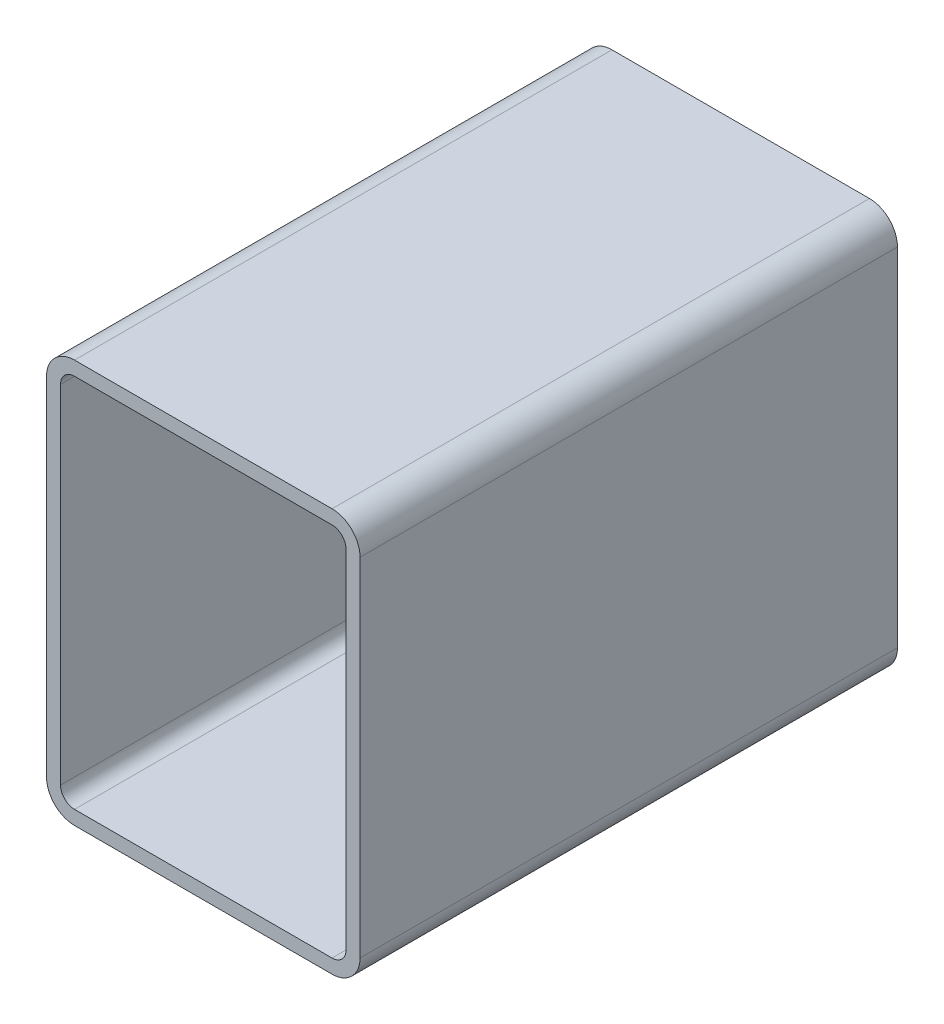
ISO-10303-21;
HEADER;
FILE_DESCRIPTION(('STEP AP214'),'2;1');
FILE_NAME('part.step','',(''),(''),'','','');
FILE_SCHEMA(('AUTOMOTIVE_DESIGN { 1 0 10303 214 1 1 1 1 }'));
ENDSEC;
DATA;
#1=APPLICATION_CONTEXT('core data for automotive mechanical design processes');
#2=APPLICATION_PROTOCOL_DEFINITION('international standard','automotive_design',2000,#1);
#3=PRODUCT_CONTEXT('',#1,'mechanical');
#4=PRODUCT('Part','Part','',(#3));
#5=PRODUCT_RELATED_PRODUCT_CATEGORY('part','',(#4));
#6=PRODUCT_DEFINITION_FORMATION('','',#4);
#7=PRODUCT_DEFINITION_CONTEXT('part definition',#1,'design');
#8=PRODUCT_DEFINITION('design','',#6,#7);
#9=PRODUCT_DEFINITION_SHAPE('','',#8);
#10=(LENGTH_UNIT() NAMED_UNIT(*) SI_UNIT(.MILLI.,.METRE.));
#11=(NAMED_UNIT(*) PLANE_ANGLE_UNIT() SI_UNIT($,.RADIAN.));
#12=(NAMED_UNIT(*) SI_UNIT($,.STERADIAN.) SOLID_ANGLE_UNIT());
#13=UNCERTAINTY_MEASURE_WITH_UNIT(LENGTH_MEASURE(1.E-05),#10,'distance_accuracy_value','');
#14=(GEOMETRIC_REPRESENTATION_CONTEXT(3) GLOBAL_UNCERTAINTY_ASSIGNED_CONTEXT((#13)) GLOBAL_UNIT_ASSIGNED_CONTEXT((#10,
#11,#12)) REPRESENTATION_CONTEXT('',''));
#15=CARTESIAN_POINT('',(0.,0.,0.));
#16=DIRECTION('',(0.,0.,1.));
#17=DIRECTION('',(1.,0.,0.));
#18=AXIS2_PLACEMENT_3D('',#15,#16,#17);
#19=CARTESIAN_POINT('',(18.0798786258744,214.668222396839,304.8));
#20=DIRECTION('',(0.,0.,1.));
#21=DIRECTION('',(1.,0.,0.));
#22=AXIS2_PLACEMENT_3D('',#19,#20,#21);
#23=PLANE('',#22);
#24=CARTESIAN_POINT('',(18.0798786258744,214.668222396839,304.8));
#25=DIRECTION('',(0.,0.,1.));
#26=DIRECTION('',(1.,0.,0.));
#27=AXIS2_PLACEMENT_3D('',#24,#25,#26);
#28=CIRCLE('',#27,15.875);
#29=CARTESIAN_POINT('',(18.0798786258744,230.543222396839,304.8));
#30=VERTEX_POINT('',#29);
#31=CARTESIAN_POINT('',(2.20487862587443,214.668222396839,304.8));
#32=VERTEX_POINT('',#31);
#33=EDGE_CURVE('E211',#30,#32,#28,.T.);
#34=ORIENTED_EDGE('',*,*,#33,.T.);
#35=DIRECTION('',(0.,-1.,0.));
#36=VECTOR('',#35,1.);
#37=CARTESIAN_POINT('',(2.20487862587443,17.8182223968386,304.8));
#38=LINE('',#37,#36);
#39=CARTESIAN_POINT('',(2.20487862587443,17.8182223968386,304.8));
#40=VERTEX_POINT('',#39);
#41=EDGE_CURVE('E214',#32,#40,#38,.T.);
#42=ORIENTED_EDGE('',*,*,#41,.T.);
#43=CARTESIAN_POINT('',(18.0798786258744,17.8182223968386,304.8));
#44=DIRECTION('',(0.,0.,1.));
#45=DIRECTION('',(1.,0.,0.));
#46=AXIS2_PLACEMENT_3D('',#43,#44,#45);
#47=CIRCLE('',#46,15.875);
#48=CARTESIAN_POINT('',(18.0798786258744,1.94322239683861,304.8));
#49=VERTEX_POINT('',#48);
#50=EDGE_CURVE('E217',#40,#49,#47,.T.);
#51=ORIENTED_EDGE('',*,*,#50,.T.);
#52=DIRECTION('',(1.,0.,0.));
#53=VECTOR('',#52,1.);
#54=CARTESIAN_POINT('',(164.129878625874,1.94322239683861,304.8));
#55=LINE('',#54,#53);
#56=CARTESIAN_POINT('',(164.129878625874,1.9432223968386,304.8));
#57=VERTEX_POINT('',#56);
#58=EDGE_CURVE('E219',#49,#57,#55,.T.);
#59=ORIENTED_EDGE('',*,*,#58,.T.);
#60=CARTESIAN_POINT('',(164.129878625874,17.8182223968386,304.8));
#61=DIRECTION('',(0.,0.,1.));
#62=DIRECTION('',(1.,0.,0.));
#63=AXIS2_PLACEMENT_3D('',#60,#61,#62);
#64=CIRCLE('',#63,15.875);
#65=CARTESIAN_POINT('',(180.004878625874,17.8182223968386,304.8));
#66=VERTEX_POINT('',#65);
#67=EDGE_CURVE('E221',#57,#66,#64,.T.);
#68=ORIENTED_EDGE('',*,*,#67,.T.);
#69=DIRECTION('',(0.,1.,0.));
#70=VECTOR('',#69,1.);
#71=CARTESIAN_POINT('',(180.004878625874,214.668222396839,304.8));
#72=LINE('',#71,#70);
#73=CARTESIAN_POINT('',(180.004878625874,214.668222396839,304.8));
#74=VERTEX_POINT('',#73);
#75=EDGE_CURVE('E223',#66,#74,#72,.T.);
#76=ORIENTED_EDGE('',*,*,#75,.T.);
#77=CARTESIAN_POINT('',(164.129878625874,214.668222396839,304.8));
#78=DIRECTION('',(0.,0.,1.));
#79=DIRECTION('',(1.,0.,0.));
#80=AXIS2_PLACEMENT_3D('',#77,#78,#79);
#81=CIRCLE('',#80,15.875);
#82=CARTESIAN_POINT('',(164.129878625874,230.543222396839,304.8));
#83=VERTEX_POINT('',#82);
#84=EDGE_CURVE('E225',#74,#83,#81,.T.);
#85=ORIENTED_EDGE('',*,*,#84,.T.);
#86=DIRECTION('',(-1.,0.,0.));
#87=VECTOR('',#86,1.);
#88=CARTESIAN_POINT('',(18.0798786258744,230.543222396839,304.8));
#89=LINE('',#88,#87);
#90=EDGE_CURVE('E227',#83,#30,#89,.T.);
#91=ORIENTED_EDGE('',*,*,#90,.T.);
#92=EDGE_LOOP('',(#34,#42,#51,#59,#68,#76,#85,#91));
#93=FACE_BOUND('',#92,.T.);
#94=DIRECTION('',(0.,-1.,0.));
#95=VECTOR('',#94,1.);
#96=CARTESIAN_POINT('',(10.1423786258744,17.8182223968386,304.8));
#97=LINE('',#96,#95);
#98=CARTESIAN_POINT('',(10.1423786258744,214.668222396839,304.8));
#99=VERTEX_POINT('',#98);
#100=CARTESIAN_POINT('',(10.1423786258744,17.8182223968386,304.8));
#101=VERTEX_POINT('',#100);
#102=EDGE_CURVE('E154',#99,#101,#97,.T.);
#103=ORIENTED_EDGE('',*,*,#102,.F.);
#104=CARTESIAN_POINT('',(18.0798786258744,214.668222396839,304.8));
#105=DIRECTION('',(0.,0.,1.));
#106=DIRECTION('',(1.,0.,0.));
#107=AXIS2_PLACEMENT_3D('',#104,#105,#106);
#108=CIRCLE('',#107,7.9375);
#109=CARTESIAN_POINT('',(18.0798786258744,222.605722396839,304.8));
#110=VERTEX_POINT('',#109);
#111=EDGE_CURVE('E146',#110,#99,#108,.T.);
#112=ORIENTED_EDGE('',*,*,#111,.F.);
#113=DIRECTION('',(-1.,0.,0.));
#114=VECTOR('',#113,1.);
#115=CARTESIAN_POINT('',(18.0798786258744,222.605722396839,304.8));
#116=LINE('',#115,#114);
#117=CARTESIAN_POINT('',(164.129878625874,222.605722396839,304.8));
#118=VERTEX_POINT('',#117);
#119=EDGE_CURVE('E179',#118,#110,#116,.T.);
#120=ORIENTED_EDGE('',*,*,#119,.F.);
#121=CARTESIAN_POINT('',(164.129878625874,214.668222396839,304.8));
#122=DIRECTION('',(0.,0.,1.));
#123=DIRECTION('',(1.,0.,0.));
#124=AXIS2_PLACEMENT_3D('',#121,#122,#123);
#125=CIRCLE('',#124,7.9375);
#126=CARTESIAN_POINT('',(172.067378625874,214.668222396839,304.8));
#127=VERTEX_POINT('',#126);
#128=EDGE_CURVE('E177',#127,#118,#125,.T.);
#129=ORIENTED_EDGE('',*,*,#128,.F.);
#130=DIRECTION('',(0.,1.,0.));
#131=VECTOR('',#130,1.);
#132=CARTESIAN_POINT('',(172.067378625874,214.668222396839,304.8));
#133=LINE('',#132,#131);
#134=CARTESIAN_POINT('',(172.067378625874,17.8182223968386,304.8));
#135=VERTEX_POINT('',#134);
#136=EDGE_CURVE('E175',#135,#127,#133,.T.);
#137=ORIENTED_EDGE('',*,*,#136,.F.);
#138=CARTESIAN_POINT('',(164.129878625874,17.8182223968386,304.8));
#139=DIRECTION('',(0.,0.,1.));
#140=DIRECTION('',(1.,0.,0.));
#141=AXIS2_PLACEMENT_3D('',#138,#139,#140);
#142=CIRCLE('',#141,7.93750000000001);
#143=CARTESIAN_POINT('',(164.129878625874,9.88072239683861,304.8));
#144=VERTEX_POINT('',#143);
#145=EDGE_CURVE('E173',#144,#135,#142,.T.);
#146=ORIENTED_EDGE('',*,*,#145,.F.);
#147=DIRECTION('',(1.,0.,0.));
#148=VECTOR('',#147,1.);
#149=CARTESIAN_POINT('',(164.129878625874,9.88072239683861,304.8));
#150=LINE('',#149,#148);
#151=CARTESIAN_POINT('',(18.0798786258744,9.88072239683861,304.8));
#152=VERTEX_POINT('',#151);
#153=EDGE_CURVE('E169',#152,#144,#150,.T.);
#154=ORIENTED_EDGE('',*,*,#153,.F.);
#155=CARTESIAN_POINT('',(18.0798786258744,17.8182223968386,304.8));
#156=DIRECTION('',(0.,0.,1.));
#157=DIRECTION('',(1.,0.,0.));
#158=AXIS2_PLACEMENT_3D('',#155,#156,#157);
#159=CIRCLE('',#158,7.9375);
#160=EDGE_CURVE('E167',#101,#152,#159,.T.);
#161=ORIENTED_EDGE('',*,*,#160,.F.);
#162=EDGE_LOOP('',(#103,#112,#120,#129,#137,#146,#154,#161));
#163=FACE_BOUND('',#162,.T.);
#164=ADVANCED_FACE('F33',(#93,#163),#23,.T.);
#165=CARTESIAN_POINT('',(18.0798786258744,214.668222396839,0.));
#166=DIRECTION('',(0.,0.,1.));
#167=DIRECTION('',(1.,0.,0.));
#168=AXIS2_PLACEMENT_3D('',#165,#166,#167);
#169=PLANE('',#168);
#170=CARTESIAN_POINT('',(18.0798786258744,214.668222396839,0.));
#171=DIRECTION('',(0.,0.,1.));
#172=DIRECTION('',(1.,0.,0.));
#173=AXIS2_PLACEMENT_3D('',#170,#171,#172);
#174=CIRCLE('',#173,15.875);
#175=CARTESIAN_POINT('',(18.0798786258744,230.543222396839,0.));
#176=VERTEX_POINT('',#175);
#177=CARTESIAN_POINT('',(2.20487862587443,214.668222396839,0.));
#178=VERTEX_POINT('',#177);
#179=EDGE_CURVE('E162',#176,#178,#174,.T.);
#180=ORIENTED_EDGE('',*,*,#179,.F.);
#181=DIRECTION('',(-1.,0.,0.));
#182=VECTOR('',#181,1.);
#183=CARTESIAN_POINT('',(18.0798786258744,230.543222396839,0.));
#184=LINE('',#183,#182);
#185=CARTESIAN_POINT('',(164.129878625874,230.543222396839,0.));
#186=VERTEX_POINT('',#185);
#187=EDGE_CURVE('E215',#186,#176,#184,.T.);
#188=ORIENTED_EDGE('',*,*,#187,.F.);
#189=CARTESIAN_POINT('',(164.129878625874,214.668222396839,0.));
#190=DIRECTION('',(0.,0.,1.));
#191=DIRECTION('',(1.,0.,0.));
#192=AXIS2_PLACEMENT_3D('',#189,#190,#191);
#193=CIRCLE('',#192,15.875);
#194=CARTESIAN_POINT('',(180.004878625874,214.668222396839,0.));
#195=VERTEX_POINT('',#194);
#196=EDGE_CURVE('E242',#195,#186,#193,.T.);
#197=ORIENTED_EDGE('',*,*,#196,.F.);
#198=DIRECTION('',(0.,1.,0.));
#199=VECTOR('',#198,1.);
#200=CARTESIAN_POINT('',(180.004878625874,214.668222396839,0.));
#201=LINE('',#200,#199);
#202=CARTESIAN_POINT('',(180.004878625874,17.8182223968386,0.));
#203=VERTEX_POINT('',#202);
#204=EDGE_CURVE('E240',#203,#195,#201,.T.);
#205=ORIENTED_EDGE('',*,*,#204,.F.);
#206=CARTESIAN_POINT('',(164.129878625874,17.8182223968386,0.));
#207=DIRECTION('',(0.,0.,1.));
#208=DIRECTION('',(1.,0.,0.));
#209=AXIS2_PLACEMENT_3D('',#206,#207,#208);
#210=CIRCLE('',#209,15.875);
#211=CARTESIAN_POINT('',(164.129878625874,1.9432223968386,0.));
#212=VERTEX_POINT('',#211);
#213=EDGE_CURVE('E238',#212,#203,#210,.T.);
#214=ORIENTED_EDGE('',*,*,#213,.F.);
#215=DIRECTION('',(1.,0.,0.));
#216=VECTOR('',#215,1.);
#217=CARTESIAN_POINT('',(164.129878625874,1.94322239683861,0.));
#218=LINE('',#217,#216);
#219=CARTESIAN_POINT('',(18.0798786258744,1.94322239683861,0.));
#220=VERTEX_POINT('',#219);
#221=EDGE_CURVE('E236',#220,#212,#218,.T.);
#222=ORIENTED_EDGE('',*,*,#221,.F.);
#223=CARTESIAN_POINT('',(18.0798786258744,17.8182223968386,0.));
#224=DIRECTION('',(0.,0.,1.));
#225=DIRECTION('',(1.,0.,0.));
#226=AXIS2_PLACEMENT_3D('',#223,#224,#225);
#227=CIRCLE('',#226,15.875);
#228=CARTESIAN_POINT('',(2.20487862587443,17.8182223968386,0.));
#229=VERTEX_POINT('',#228);
#230=EDGE_CURVE('E234',#229,#220,#227,.T.);
#231=ORIENTED_EDGE('',*,*,#230,.F.);
#232=DIRECTION('',(0.,-1.,0.));
#233=VECTOR('',#232,1.);
#234=CARTESIAN_POINT('',(2.20487862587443,17.8182223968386,0.));
#235=LINE('',#234,#233);
#236=EDGE_CURVE('E232',#178,#229,#235,.T.);
#237=ORIENTED_EDGE('',*,*,#236,.F.);
#238=EDGE_LOOP('',(#180,#188,#197,#205,#214,#222,#231,#237));
#239=FACE_BOUND('',#238,.T.);
#240=CARTESIAN_POINT('',(18.0798786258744,214.668222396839,0.));
#241=DIRECTION('',(0.,0.,1.));
#242=DIRECTION('',(1.,0.,0.));
#243=AXIS2_PLACEMENT_3D('',#240,#241,#242);
#244=CIRCLE('',#243,7.9375);
#245=CARTESIAN_POINT('',(18.0798786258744,222.605722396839,0.));
#246=VERTEX_POINT('',#245);
#247=CARTESIAN_POINT('',(10.1423786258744,214.668222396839,0.));
#248=VERTEX_POINT('',#247);
#249=EDGE_CURVE('E56',#246,#248,#244,.T.);
#250=ORIENTED_EDGE('',*,*,#249,.T.);
#251=DIRECTION('',(0.,-1.,0.));
#252=VECTOR('',#251,1.);
#253=CARTESIAN_POINT('',(10.1423786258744,17.8182223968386,0.));
#254=LINE('',#253,#252);
#255=CARTESIAN_POINT('',(10.1423786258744,17.8182223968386,0.));
#256=VERTEX_POINT('',#255);
#257=EDGE_CURVE('E161',#248,#256,#254,.T.);
#258=ORIENTED_EDGE('',*,*,#257,.T.);
#259=CARTESIAN_POINT('',(18.0798786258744,17.8182223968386,0.));
#260=DIRECTION('',(0.,0.,1.));
#261=DIRECTION('',(1.,0.,0.));
#262=AXIS2_PLACEMENT_3D('',#259,#260,#261);
#263=CIRCLE('',#262,7.9375);
#264=CARTESIAN_POINT('',(18.0798786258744,9.88072239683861,0.));
#265=VERTEX_POINT('',#264);
#266=EDGE_CURVE('E183',#256,#265,#263,.T.);
#267=ORIENTED_EDGE('',*,*,#266,.T.);
#268=DIRECTION('',(1.,0.,0.));
#269=VECTOR('',#268,1.);
#270=CARTESIAN_POINT('',(164.129878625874,9.88072239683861,0.));
#271=LINE('',#270,#269);
#272=CARTESIAN_POINT('',(164.129878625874,9.88072239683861,0.));
#273=VERTEX_POINT('',#272);
#274=EDGE_CURVE('E186',#265,#273,#271,.T.);
#275=ORIENTED_EDGE('',*,*,#274,.T.);
#276=CARTESIAN_POINT('',(164.129878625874,17.8182223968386,0.));
#277=DIRECTION('',(0.,0.,1.));
#278=DIRECTION('',(1.,0.,0.));
#279=AXIS2_PLACEMENT_3D('',#276,#277,#278);
#280=CIRCLE('',#279,7.93750000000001);
#281=CARTESIAN_POINT('',(172.067378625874,17.8182223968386,0.));
#282=VERTEX_POINT('',#281);
#283=EDGE_CURVE('E189',#273,#282,#280,.T.);
#284=ORIENTED_EDGE('',*,*,#283,.T.);
#285=DIRECTION('',(0.,1.,0.));
#286=VECTOR('',#285,1.);
#287=CARTESIAN_POINT('',(172.067378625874,214.668222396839,0.));
#288=LINE('',#287,#286);
#289=CARTESIAN_POINT('',(172.067378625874,214.668222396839,0.));
#290=VERTEX_POINT('',#289);
#291=EDGE_CURVE('E192',#282,#290,#288,.T.);
#292=ORIENTED_EDGE('',*,*,#291,.T.);
#293=CARTESIAN_POINT('',(164.129878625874,214.668222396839,0.));
#294=DIRECTION('',(0.,0.,1.));
#295=DIRECTION('',(1.,0.,0.));
#296=AXIS2_PLACEMENT_3D('',#293,#294,#295);
#297=CIRCLE('',#296,7.9375);
#298=CARTESIAN_POINT('',(164.129878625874,222.605722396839,0.));
#299=VERTEX_POINT('',#298);
#300=EDGE_CURVE('E195',#290,#299,#297,.T.);
#301=ORIENTED_EDGE('',*,*,#300,.T.);
#302=DIRECTION('',(-1.,0.,0.));
#303=VECTOR('',#302,1.);
#304=CARTESIAN_POINT('',(18.0798786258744,222.605722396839,0.));
#305=LINE('',#304,#303);
#306=EDGE_CURVE('E155',#299,#246,#305,.T.);
#307=ORIENTED_EDGE('',*,*,#306,.T.);
#308=EDGE_LOOP('',(#250,#258,#267,#275,#284,#292,#301,#307));
#309=FACE_BOUND('',#308,.T.);
#310=ADVANCED_FACE('F272',(#239,#309),#169,.F.);
#311=CARTESIAN_POINT('',(18.0798786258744,214.668222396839,304.8));
#312=DIRECTION('',(0.,0.,-1.));
#313=DIRECTION('',(-1.,0.,0.));
#314=AXIS2_PLACEMENT_3D('',#311,#312,#313);
#315=CYLINDRICAL_SURFACE('',#314,15.875);
#316=ORIENTED_EDGE('',*,*,#179,.T.);
#317=DIRECTION('',(0.,0.,-1.));
#318=VECTOR('',#317,1.);
#319=CARTESIAN_POINT('',(2.20487862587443,214.668222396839,304.8));
#320=LINE('',#319,#318);
#321=EDGE_CURVE('E11',#32,#178,#320,.T.);
#322=ORIENTED_EDGE('',*,*,#321,.F.);
#323=ORIENTED_EDGE('',*,*,#33,.F.);
#324=DIRECTION('',(0.,0.,-1.));
#325=VECTOR('',#324,1.);
#326=CARTESIAN_POINT('',(18.0798786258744,230.543222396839,304.8));
#327=LINE('',#326,#325);
#328=EDGE_CURVE('E229',#30,#176,#327,.T.);
#329=ORIENTED_EDGE('',*,*,#328,.T.);
#330=EDGE_LOOP('',(#316,#322,#323,#329));
#331=FACE_BOUND('',#330,.T.);
#332=ADVANCED_FACE('F35',(#331),#315,.T.);
#333=CARTESIAN_POINT('',(2.20487862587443,17.8182223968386,304.8));
#334=DIRECTION('',(1.,0.,0.));
#335=DIRECTION('',(0.,0.,-1.));
#336=AXIS2_PLACEMENT_3D('',#333,#334,#335);
#337=PLANE('',#336);
#338=ORIENTED_EDGE('',*,*,#236,.T.);
#339=DIRECTION('',(0.,0.,-1.));
#340=VECTOR('',#339,1.);
#341=CARTESIAN_POINT('',(2.20487862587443,17.8182223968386,304.8));
#342=LINE('',#341,#340);
#343=EDGE_CURVE('E41',#40,#229,#342,.T.);
#344=ORIENTED_EDGE('',*,*,#343,.F.);
#345=ORIENTED_EDGE('',*,*,#41,.F.);
#346=ORIENTED_EDGE('',*,*,#321,.T.);
#347=EDGE_LOOP('',(#338,#344,#345,#346));
#348=FACE_BOUND('',#347,.T.);
#349=ADVANCED_FACE('F289',(#348),#337,.F.);
#350=CARTESIAN_POINT('',(18.0798786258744,17.8182223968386,304.8));
#351=DIRECTION('',(0.,0.,-1.));
#352=DIRECTION('',(-1.,0.,0.));
#353=AXIS2_PLACEMENT_3D('',#350,#351,#352);
#354=CYLINDRICAL_SURFACE('',#353,15.875);
#355=ORIENTED_EDGE('',*,*,#230,.T.);
#356=DIRECTION('',(0.,0.,-1.));
#357=VECTOR('',#356,1.);
#358=CARTESIAN_POINT('',(18.0798786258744,1.94322239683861,304.8));
#359=LINE('',#358,#357);
#360=EDGE_CURVE('E259',#49,#220,#359,.T.);
#361=ORIENTED_EDGE('',*,*,#360,.F.);
#362=ORIENTED_EDGE('',*,*,#50,.F.);
#363=ORIENTED_EDGE('',*,*,#343,.T.);
#364=EDGE_LOOP('',(#355,#361,#362,#363));
#365=FACE_BOUND('',#364,.T.);
#366=ADVANCED_FACE('F266',(#365),#354,.T.);
#367=CARTESIAN_POINT('',(164.129878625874,1.94322239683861,304.8));
#368=DIRECTION('',(0.,1.,0.));
#369=DIRECTION('',(0.,0.,1.));
#370=AXIS2_PLACEMENT_3D('',#367,#368,#369);
#371=PLANE('',#370);
#372=ORIENTED_EDGE('',*,*,#221,.T.);
#373=DIRECTION('',(0.,0.,-1.));
#374=VECTOR('',#373,1.);
#375=CARTESIAN_POINT('',(164.129878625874,1.9432223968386,304.8));
#376=LINE('',#375,#374);
#377=EDGE_CURVE('E256',#57,#212,#376,.T.);
#378=ORIENTED_EDGE('',*,*,#377,.F.);
#379=ORIENTED_EDGE('',*,*,#58,.F.);
#380=ORIENTED_EDGE('',*,*,#360,.T.);
#381=EDGE_LOOP('',(#372,#378,#379,#380));
#382=FACE_BOUND('',#381,.T.);
#383=ADVANCED_FACE('F278',(#382),#371,.F.);
#384=CARTESIAN_POINT('',(164.129878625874,17.8182223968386,304.8));
#385=DIRECTION('',(0.,0.,-1.));
#386=DIRECTION('',(-1.,0.,0.));
#387=AXIS2_PLACEMENT_3D('',#384,#385,#386);
#388=CYLINDRICAL_SURFACE('',#387,15.875);
#389=ORIENTED_EDGE('',*,*,#213,.T.);
#390=DIRECTION('',(0.,0.,-1.));
#391=VECTOR('',#390,1.);
#392=CARTESIAN_POINT('',(180.004878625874,17.8182223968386,304.8));
#393=LINE('',#392,#391);
#394=EDGE_CURVE('E253',#66,#203,#393,.T.);
#395=ORIENTED_EDGE('',*,*,#394,.F.);
#396=ORIENTED_EDGE('',*,*,#67,.F.);
#397=ORIENTED_EDGE('',*,*,#377,.T.);
#398=EDGE_LOOP('',(#389,#395,#396,#397));
#399=FACE_BOUND('',#398,.T.);
#400=ADVANCED_FACE('F282',(#399),#388,.T.);
#401=CARTESIAN_POINT('',(180.004878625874,214.668222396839,304.8));
#402=DIRECTION('',(-1.,0.,0.));
#403=DIRECTION('',(0.,0.,1.));
#404=AXIS2_PLACEMENT_3D('',#401,#402,#403);
#405=PLANE('',#404);
#406=ORIENTED_EDGE('',*,*,#204,.T.);
#407=DIRECTION('',(0.,0.,-1.));
#408=VECTOR('',#407,1.);
#409=CARTESIAN_POINT('',(180.004878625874,214.668222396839,304.8));
#410=LINE('',#409,#408);
#411=EDGE_CURVE('E250',#74,#195,#410,.T.);
#412=ORIENTED_EDGE('',*,*,#411,.F.);
#413=ORIENTED_EDGE('',*,*,#75,.F.);
#414=ORIENTED_EDGE('',*,*,#394,.T.);
#415=EDGE_LOOP('',(#406,#412,#413,#414));
#416=FACE_BOUND('',#415,.T.);
#417=ADVANCED_FACE('F302',(#416),#405,.F.);
#418=CARTESIAN_POINT('',(164.129878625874,214.668222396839,304.8));
#419=DIRECTION('',(0.,0.,-1.));
#420=DIRECTION('',(-1.,0.,0.));
#421=AXIS2_PLACEMENT_3D('',#418,#419,#420);
#422=CYLINDRICAL_SURFACE('',#421,15.875);
#423=ORIENTED_EDGE('',*,*,#196,.T.);
#424=DIRECTION('',(0.,0.,-1.));
#425=VECTOR('',#424,1.);
#426=CARTESIAN_POINT('',(164.129878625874,230.543222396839,304.8));
#427=LINE('',#426,#425);
#428=EDGE_CURVE('E247',#83,#186,#427,.T.);
#429=ORIENTED_EDGE('',*,*,#428,.F.);
#430=ORIENTED_EDGE('',*,*,#84,.F.);
#431=ORIENTED_EDGE('',*,*,#411,.T.);
#432=EDGE_LOOP('',(#423,#429,#430,#431));
#433=FACE_BOUND('',#432,.T.);
#434=ADVANCED_FACE('F300',(#433),#422,.T.);
#435=CARTESIAN_POINT('',(18.0798786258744,230.543222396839,304.8));
#436=DIRECTION('',(0.,-1.,0.));
#437=DIRECTION('',(0.,0.,-1.));
#438=AXIS2_PLACEMENT_3D('',#435,#436,#437);
#439=PLANE('',#438);
#440=ORIENTED_EDGE('',*,*,#187,.T.);
#441=ORIENTED_EDGE('',*,*,#328,.F.);
#442=ORIENTED_EDGE('',*,*,#90,.F.);
#443=ORIENTED_EDGE('',*,*,#428,.T.);
#444=EDGE_LOOP('',(#440,#441,#442,#443));
#445=FACE_BOUND('',#444,.T.);
#446=ADVANCED_FACE('F295',(#445),#439,.F.);
#447=CARTESIAN_POINT('',(18.0798786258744,214.668222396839,304.8));
#448=DIRECTION('',(0.,0.,-1.));
#449=DIRECTION('',(-1.,0.,0.));
#450=AXIS2_PLACEMENT_3D('',#447,#448,#449);
#451=CYLINDRICAL_SURFACE('',#450,7.9375);
#452=ORIENTED_EDGE('',*,*,#249,.F.);
#453=DIRECTION('',(0.,0.,-1.));
#454=VECTOR('',#453,1.);
#455=CARTESIAN_POINT('',(18.0798786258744,222.605722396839,304.8));
#456=LINE('',#455,#454);
#457=EDGE_CURVE('E150',#110,#246,#456,.T.);
#458=ORIENTED_EDGE('',*,*,#457,.F.);
#459=ORIENTED_EDGE('',*,*,#111,.T.);
#460=DIRECTION('',(0.,0.,-1.));
#461=VECTOR('',#460,1.);
#462=CARTESIAN_POINT('',(10.1423786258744,214.668222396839,304.8));
#463=LINE('',#462,#461);
#464=EDGE_CURVE('E149',#99,#248,#463,.T.);
#465=ORIENTED_EDGE('',*,*,#464,.T.);
#466=EDGE_LOOP('',(#452,#458,#459,#465));
#467=FACE_BOUND('',#466,.T.);
#468=ADVANCED_FACE('F148',(#467),#451,.F.);
#469=CARTESIAN_POINT('',(10.1423786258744,17.8182223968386,304.8));
#470=DIRECTION('',(1.,0.,0.));
#471=DIRECTION('',(0.,0.,-1.));
#472=AXIS2_PLACEMENT_3D('',#469,#470,#471);
#473=PLANE('',#472);
#474=ORIENTED_EDGE('',*,*,#257,.F.);
#475=ORIENTED_EDGE('',*,*,#464,.F.);
#476=ORIENTED_EDGE('',*,*,#102,.T.);
#477=DIRECTION('',(0.,0.,-1.));
#478=VECTOR('',#477,1.);
#479=CARTESIAN_POINT('',(10.1423786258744,17.8182223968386,304.8));
#480=LINE('',#479,#478);
#481=EDGE_CURVE('E163',#101,#256,#480,.T.);
#482=ORIENTED_EDGE('',*,*,#481,.T.);
#483=EDGE_LOOP('',(#474,#475,#476,#482));
#484=FACE_BOUND('',#483,.T.);
#485=ADVANCED_FACE('F158',(#484),#473,.T.);
#486=CARTESIAN_POINT('',(18.0798786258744,17.8182223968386,304.8));
#487=DIRECTION('',(0.,0.,-1.));
#488=DIRECTION('',(-1.,0.,0.));
#489=AXIS2_PLACEMENT_3D('',#486,#487,#488);
#490=CYLINDRICAL_SURFACE('',#489,7.9375);
#491=ORIENTED_EDGE('',*,*,#266,.F.);
#492=ORIENTED_EDGE('',*,*,#481,.F.);
#493=ORIENTED_EDGE('',*,*,#160,.T.);
#494=DIRECTION('',(0.,0.,-1.));
#495=VECTOR('',#494,1.);
#496=CARTESIAN_POINT('',(18.0798786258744,9.88072239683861,304.8));
#497=LINE('',#496,#495);
#498=EDGE_CURVE('E208',#152,#265,#497,.T.);
#499=ORIENTED_EDGE('',*,*,#498,.T.);
#500=EDGE_LOOP('',(#491,#492,#493,#499));
#501=FACE_BOUND('',#500,.T.);
#502=ADVANCED_FACE('F327',(#501),#490,.F.);
#503=CARTESIAN_POINT('',(164.129878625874,9.88072239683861,304.8));
#504=DIRECTION('',(0.,1.,0.));
#505=DIRECTION('',(0.,0.,1.));
#506=AXIS2_PLACEMENT_3D('',#503,#504,#505);
#507=PLANE('',#506);
#508=ORIENTED_EDGE('',*,*,#274,.F.);
#509=ORIENTED_EDGE('',*,*,#498,.F.);
#510=ORIENTED_EDGE('',*,*,#153,.T.);
#511=DIRECTION('',(0.,0.,-1.));
#512=VECTOR('',#511,1.);
#513=CARTESIAN_POINT('',(164.129878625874,9.88072239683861,304.8));
#514=LINE('',#513,#512);
#515=EDGE_CURVE('E206',#144,#273,#514,.T.);
#516=ORIENTED_EDGE('',*,*,#515,.T.);
#517=EDGE_LOOP('',(#508,#509,#510,#516));
#518=FACE_BOUND('',#517,.T.);
#519=ADVANCED_FACE('F331',(#518),#507,.T.);
#520=CARTESIAN_POINT('',(164.129878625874,17.8182223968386,304.8));
#521=DIRECTION('',(0.,0.,-1.));
#522=DIRECTION('',(-1.,0.,0.));
#523=AXIS2_PLACEMENT_3D('',#520,#521,#522);
#524=CYLINDRICAL_SURFACE('',#523,7.93750000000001);
#525=ORIENTED_EDGE('',*,*,#283,.F.);
#526=ORIENTED_EDGE('',*,*,#515,.F.);
#527=ORIENTED_EDGE('',*,*,#145,.T.);
#528=DIRECTION('',(0.,0.,-1.));
#529=VECTOR('',#528,1.);
#530=CARTESIAN_POINT('',(172.067378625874,17.8182223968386,304.8));
#531=LINE('',#530,#529);
#532=EDGE_CURVE('E204',#135,#282,#531,.T.);
#533=ORIENTED_EDGE('',*,*,#532,.T.);
#534=EDGE_LOOP('',(#525,#526,#527,#533));
#535=FACE_BOUND('',#534,.T.);
#536=ADVANCED_FACE('F337',(#535),#524,.F.);
#537=CARTESIAN_POINT('',(172.067378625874,214.668222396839,304.8));
#538=DIRECTION('',(-1.,0.,0.));
#539=DIRECTION('',(0.,0.,1.));
#540=AXIS2_PLACEMENT_3D('',#537,#538,#539);
#541=PLANE('',#540);
#542=ORIENTED_EDGE('',*,*,#291,.F.);
#543=ORIENTED_EDGE('',*,*,#532,.F.);
#544=ORIENTED_EDGE('',*,*,#136,.T.);
#545=DIRECTION('',(0.,0.,-1.));
#546=VECTOR('',#545,1.);
#547=CARTESIAN_POINT('',(172.067378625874,214.668222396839,304.8));
#548=LINE('',#547,#546);
#549=EDGE_CURVE('E202',#127,#290,#548,.T.);
#550=ORIENTED_EDGE('',*,*,#549,.T.);
#551=EDGE_LOOP('',(#542,#543,#544,#550));
#552=FACE_BOUND('',#551,.T.);
#553=ADVANCED_FACE('F341',(#552),#541,.T.);
#554=CARTESIAN_POINT('',(164.129878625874,214.668222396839,304.8));
#555=DIRECTION('',(0.,0.,-1.));
#556=DIRECTION('',(-1.,0.,0.));
#557=AXIS2_PLACEMENT_3D('',#554,#555,#556);
#558=CYLINDRICAL_SURFACE('',#557,7.9375);
#559=ORIENTED_EDGE('',*,*,#300,.F.);
#560=ORIENTED_EDGE('',*,*,#549,.F.);
#561=ORIENTED_EDGE('',*,*,#128,.T.);
#562=DIRECTION('',(0.,0.,-1.));
#563=VECTOR('',#562,1.);
#564=CARTESIAN_POINT('',(164.129878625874,222.605722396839,304.8));
#565=LINE('',#564,#563);
#566=EDGE_CURVE('E48',#118,#299,#565,.T.);
#567=ORIENTED_EDGE('',*,*,#566,.T.);
#568=EDGE_LOOP('',(#559,#560,#561,#567));
#569=FACE_BOUND('',#568,.T.);
#570=ADVANCED_FACE('F345',(#569),#558,.F.);
#571=CARTESIAN_POINT('',(18.0798786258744,222.605722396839,304.8));
#572=DIRECTION('',(0.,-1.,0.));
#573=DIRECTION('',(0.,0.,-1.));
#574=AXIS2_PLACEMENT_3D('',#571,#572,#573);
#575=PLANE('',#574);
#576=ORIENTED_EDGE('',*,*,#306,.F.);
#577=ORIENTED_EDGE('',*,*,#566,.F.);
#578=ORIENTED_EDGE('',*,*,#119,.T.);
#579=ORIENTED_EDGE('',*,*,#457,.T.);
#580=EDGE_LOOP('',(#576,#577,#578,#579));
#581=FACE_BOUND('',#580,.T.);
#582=ADVANCED_FACE('F349',(#581),#575,.T.);
#583=CLOSED_SHELL('',(#164,#310,#332,#349,#366,#383,#400,#417,#434,#446,#468,#485,#502,#519,
#536,#553,#570,#582));
#584=MANIFOLD_SOLID_BREP('B2',#583);
#585=ADVANCED_BREP_SHAPE_REPRESENTATION('',(#18,#584),#14);
#586=SHAPE_DEFINITION_REPRESENTATION(#9,#585);
ENDSEC;
END-ISO-10303-21;
